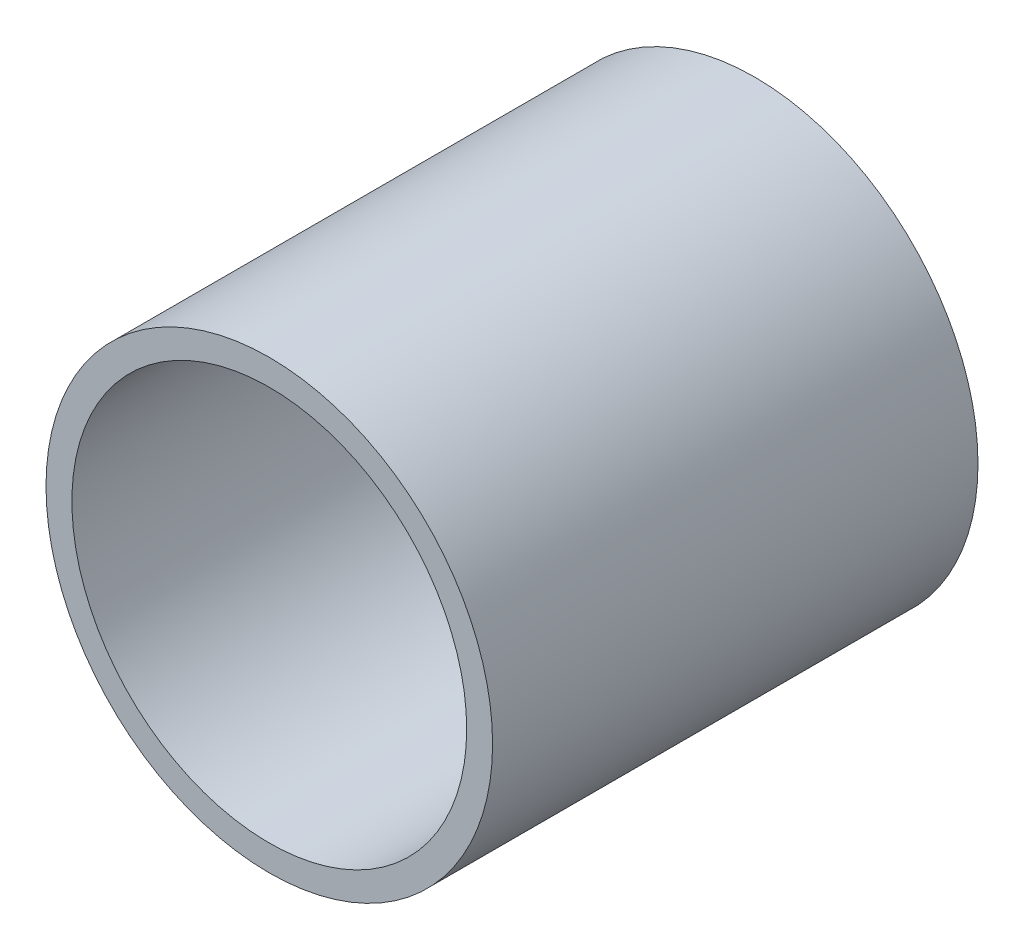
ISO-10303-21;
HEADER;
FILE_DESCRIPTION(('STEP AP214'),'2;1');
FILE_NAME('part.step','',(''),(''),'','','');
FILE_SCHEMA(('AUTOMOTIVE_DESIGN { 1 0 10303 214 1 1 1 1 }'));
ENDSEC;
DATA;
#1=APPLICATION_CONTEXT('core data for automotive mechanical design processes');
#2=APPLICATION_PROTOCOL_DEFINITION('international standard','automotive_design',2000,#1);
#3=PRODUCT_CONTEXT('',#1,'mechanical');
#4=PRODUCT('Part','Part','',(#3));
#5=PRODUCT_RELATED_PRODUCT_CATEGORY('part','',(#4));
#6=PRODUCT_DEFINITION_FORMATION('','',#4);
#7=PRODUCT_DEFINITION_CONTEXT('part definition',#1,'design');
#8=PRODUCT_DEFINITION('design','',#6,#7);
#9=PRODUCT_DEFINITION_SHAPE('','',#8);
#10=(LENGTH_UNIT() NAMED_UNIT(*) SI_UNIT(.MILLI.,.METRE.));
#11=(NAMED_UNIT(*) PLANE_ANGLE_UNIT() SI_UNIT($,.RADIAN.));
#12=(NAMED_UNIT(*) SI_UNIT($,.STERADIAN.) SOLID_ANGLE_UNIT());
#13=UNCERTAINTY_MEASURE_WITH_UNIT(LENGTH_MEASURE(1.E-05),#10,'distance_accuracy_value','');
#14=(GEOMETRIC_REPRESENTATION_CONTEXT(3) GLOBAL_UNCERTAINTY_ASSIGNED_CONTEXT((#13)) GLOBAL_UNIT_ASSIGNED_CONTEXT((#10,
#11,#12)) REPRESENTATION_CONTEXT('',''));
#15=CARTESIAN_POINT('',(0.,0.,0.));
#16=DIRECTION('',(0.,0.,1.));
#17=DIRECTION('',(1.,0.,0.));
#18=AXIS2_PLACEMENT_3D('',#15,#16,#17);
#19=CARTESIAN_POINT('',(0.,0.,15.));
#20=DIRECTION('',(0.,0.,1.));
#21=DIRECTION('',(1.,0.,0.));
#22=AXIS2_PLACEMENT_3D('',#19,#20,#21);
#23=PLANE('',#22);
#24=CARTESIAN_POINT('',(0.,0.,15.));
#25=DIRECTION('',(0.,0.,1.));
#26=DIRECTION('',(1.,0.,0.));
#27=AXIS2_PLACEMENT_3D('',#24,#25,#26);
#28=CIRCLE('',#27,6.9);
#29=CARTESIAN_POINT('',(6.9,0.,15.));
#30=VERTEX_POINT('',#29);
#31=EDGE_CURVE('E10',#30,#30,#28,.T.);
#32=ORIENTED_EDGE('',*,*,#31,.T.);
#33=EDGE_LOOP('',(#32));
#34=FACE_BOUND('',#33,.T.);
#35=CARTESIAN_POINT('',(0.,0.,15.));
#36=DIRECTION('',(0.,0.,1.));
#37=DIRECTION('',(1.,0.,0.));
#38=AXIS2_PLACEMENT_3D('',#35,#36,#37);
#39=CIRCLE('',#38,6.1);
#40=CARTESIAN_POINT('',(6.1,0.,15.));
#41=VERTEX_POINT('',#40);
#42=EDGE_CURVE('E37',#41,#41,#39,.T.);
#43=ORIENTED_EDGE('',*,*,#42,.F.);
#44=EDGE_LOOP('',(#43));
#45=FACE_BOUND('',#44,.T.);
#46=ADVANCED_FACE('F26',(#34,#45),#23,.T.);
#47=CARTESIAN_POINT('',(0.,0.,0.));
#48=DIRECTION('',(0.,0.,1.));
#49=DIRECTION('',(1.,0.,0.));
#50=AXIS2_PLACEMENT_3D('',#47,#48,#49);
#51=PLANE('',#50);
#52=CARTESIAN_POINT('',(0.,0.,0.));
#53=DIRECTION('',(0.,0.,1.));
#54=DIRECTION('',(1.,0.,0.));
#55=AXIS2_PLACEMENT_3D('',#52,#53,#54);
#56=CIRCLE('',#55,6.9);
#57=CARTESIAN_POINT('',(6.9,0.,0.));
#58=VERTEX_POINT('',#57);
#59=EDGE_CURVE('E33',#58,#58,#56,.T.);
#60=ORIENTED_EDGE('',*,*,#59,.F.);
#61=EDGE_LOOP('',(#60));
#62=FACE_BOUND('',#61,.T.);
#63=CARTESIAN_POINT('',(0.,0.,0.));
#64=DIRECTION('',(0.,0.,1.));
#65=DIRECTION('',(1.,0.,0.));
#66=AXIS2_PLACEMENT_3D('',#63,#64,#65);
#67=CIRCLE('',#66,6.1);
#68=CARTESIAN_POINT('',(6.1,0.,0.));
#69=VERTEX_POINT('',#68);
#70=EDGE_CURVE('E41',#69,#69,#67,.T.);
#71=ORIENTED_EDGE('',*,*,#70,.T.);
#72=EDGE_LOOP('',(#71));
#73=FACE_BOUND('',#72,.T.);
#74=ADVANCED_FACE('F47',(#62,#73),#51,.F.);
#75=CARTESIAN_POINT('',(0.,0.,15.));
#76=DIRECTION('',(0.,0.,-1.));
#77=DIRECTION('',(-1.,0.,0.));
#78=AXIS2_PLACEMENT_3D('',#75,#76,#77);
#79=CYLINDRICAL_SURFACE('',#78,6.9);
#80=ORIENTED_EDGE('',*,*,#31,.F.);
#81=EDGE_LOOP('',(#80));
#82=FACE_BOUND('',#81,.T.);
#83=ORIENTED_EDGE('',*,*,#59,.T.);
#84=EDGE_LOOP('',(#83));
#85=FACE_BOUND('',#84,.T.);
#86=ADVANCED_FACE('F28',(#82,#85),#79,.T.);
#87=CARTESIAN_POINT('',(0.,0.,15.));
#88=DIRECTION('',(0.,0.,-1.));
#89=DIRECTION('',(-1.,0.,0.));
#90=AXIS2_PLACEMENT_3D('',#87,#88,#89);
#91=CYLINDRICAL_SURFACE('',#90,6.1);
#92=ORIENTED_EDGE('',*,*,#42,.T.);
#93=EDGE_LOOP('',(#92));
#94=FACE_BOUND('',#93,.T.);
#95=ORIENTED_EDGE('',*,*,#70,.F.);
#96=EDGE_LOOP('',(#95));
#97=FACE_BOUND('',#96,.T.);
#98=ADVANCED_FACE('F49',(#94,#97),#91,.F.);
#99=CLOSED_SHELL('',(#46,#74,#86,#98));
#100=MANIFOLD_SOLID_BREP('B2',#99);
#101=ADVANCED_BREP_SHAPE_REPRESENTATION('',(#18,#100),#14);
#102=SHAPE_DEFINITION_REPRESENTATION(#9,#101);
ENDSEC;
END-ISO-10303-21;
